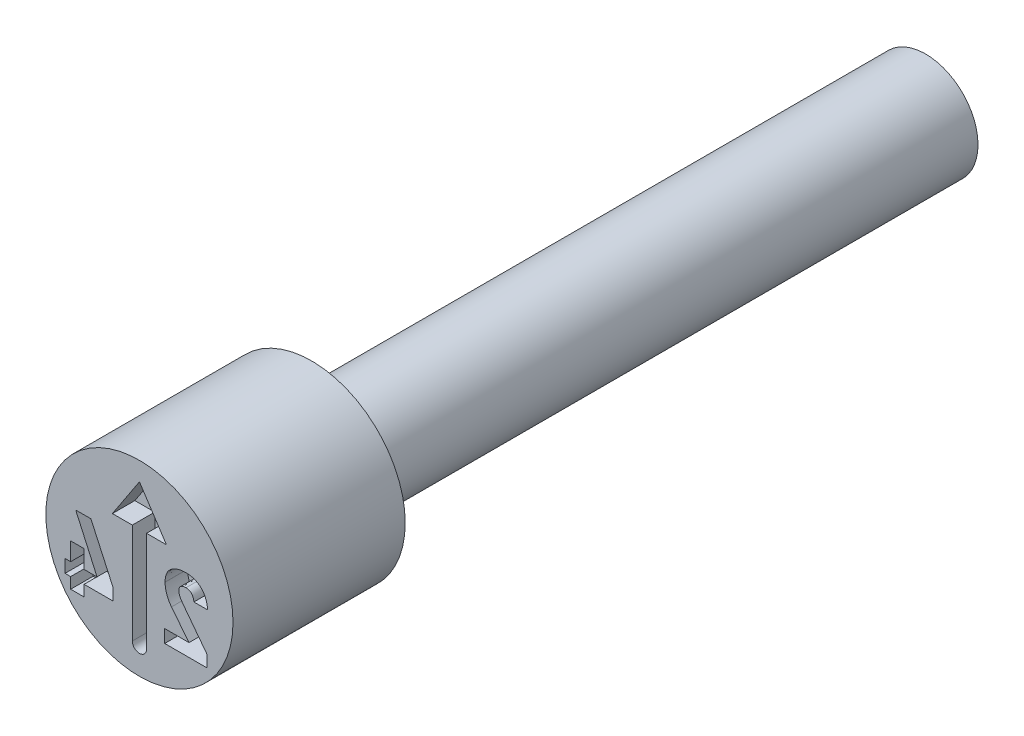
from build123d import *

# Parameters (mm, degrees)
CUT_EXTRUDE4_DEPTH = 0.3
SKETCH4_W          = 0.179080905
SKETCH4_H          = 0.559313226
CUT_EXTRUDE5_DEPTH = 0.3


with BuildPart() as part:
    # Sketch2 → Revolve1 (revolve)
    with BuildSketch(Plane(origin=(0, 0, 0), x_dir=(0, 0, -1), z_dir=(1, 0, 0)), mode=Mode.PRIVATE) as revolve1_sk:
        Polygon((0, 1.25), (0, 0), (10.5, 0), (10.5, 0.7), (2.3, 0.7), (2.3, 1.25), align=None)
    revolve(revolve1_sk.sketch.rotate(Axis((0, 0, -0.403888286), (0, 0, -1)), 90), axis=Axis((0, 0, -0.403888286), (0, 0, -1)))

    # Sketch3 → Cut-Extrude4 (cut)
    with BuildSketch(Plane.XY):
        with BuildLine():
            Line((0.095236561, 0.453175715), (0.095236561, -0.888080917))
            ThreePointArc((0.095236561, -0.888080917), (0, -0.983317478), (-0.095236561, -0.888080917))
            Line((-0.095236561, -0.888080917), (-0.095236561, 0.453175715))
            Line((-0.095236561, 0.453175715), (-0.360958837, 0.453175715))
            Line((-0.360958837, 0.453175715), (0, 1.001057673))
            Line((0, 1.001057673), (0.360958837, 0.453175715))
            Line((0.360958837, 0.453175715), (0.095236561, 0.453175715))
        make_face()
    extrude(amount=-CUT_EXTRUDE4_DEPTH, mode=Mode.SUBTRACT)

    # Sketch4 → Cut-Extrude5 (cut)
    with BuildSketch(Plane.XY):
        with BuildLine():
            Line((0.899358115, -0.538536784), (0.573334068, -0.109904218))
            add(Edge.make_bspline(
                [(0.573334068, -0.109904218), (0.566496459, -0.10041768), (0.553148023, -0.081897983), (0.541205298, -0.05635414), (0.533618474, -0.036325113), (0.530110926, -0.02179639), (0.527514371, -0.007903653), (0.527211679, 0.001211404), (0.527063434, 0.005675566)],
                knots=[0, 0, 0, 0, 1.660423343, 3.241491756, 3.993801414, 4.704207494, 5.365376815, 6, 6, 6, 6], degree=3))
            Line((0.527063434, 0.005675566), (0.527063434, 0.007030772))
            add(Edge.make_bspline(
                [(0.527063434, 0.007030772), (0.527323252, 0.013130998), (0.527818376, 0.024755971), (0.532598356, 0.041111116), (0.540502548, 0.055253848), (0.551574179, 0.067109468), (0.565657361, 0.07622106), (0.582269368, 0.082877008), (0.601498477, 0.086643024), (0.615135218, 0.08712265), (0.622315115, 0.087375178)],
                knots=[0, 0, 0, 0, 1.033361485, 1.969238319, 2.861873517, 3.760870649, 4.693536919, 5.686153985, 6.781734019, 8, 8, 8, 8], degree=3))
            add(Edge.make_bspline(
                [(0.622315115, 0.087375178), (0.62938521, 0.087076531), (0.643106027, 0.086496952), (0.662623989, 0.08097414), (0.679962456, 0.07159799), (0.694971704, 0.058639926), (0.707565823, 0.042338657), (0.716848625, 0.022700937), (0.724324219, 0.000381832), (0.726493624, -0.015817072), (0.727634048, -0.024332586)],
                knots=[0, 0, 0, 0, 0.993701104, 1.928459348, 2.826878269, 3.748294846, 4.700551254, 5.70417143, 6.793118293, 8, 8, 8, 8], degree=3))
            Line((0.727634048, -0.024332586), (0.911167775, -0.02510699))
            add(Edge.make_bspline(
                [(0.911167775, -0.02510699), (0.909852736, -0.010030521), (0.90729096, 0.017830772), (0.898580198, 0.057897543), (0.885711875, 0.094764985), (0.869270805, 0.128534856), (0.849111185, 0.158780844), (0.825720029, 0.185494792), (0.798838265, 0.208157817), (0.76893152, 0.226989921), (0.736130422, 0.24172795), (0.700836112, 0.252466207), (0.662995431, 0.258656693), (0.636986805, 0.259461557), (0.623670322, 0.25987365)],
                knots=[0, 0, 0, 0, 1.143950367, 2.228484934, 3.258162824, 4.249580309, 5.213917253, 6.146796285, 7.070112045, 8.006232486, 8.954636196, 9.927630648, 10.9389416, 12, 12, 12, 12], degree=3))
            add(Edge.make_bspline(
                [(0.623670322, 0.25987365), (0.609390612, 0.259575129), (0.581753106, 0.25899736), (0.541956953, 0.253558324), (0.505363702, 0.244507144), (0.472065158, 0.231790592), (0.442279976, 0.215443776), (0.415870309, 0.196040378), (0.393581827, 0.172827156), (0.375042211, 0.14645659), (0.36042731, 0.117030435), (0.350192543, 0.084574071), (0.343924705, 0.049348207), (0.343152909, 0.024868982), (0.342755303, 0.012257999)],
                knots=[0, 0, 0, 0, 1.208591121, 2.339154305, 3.392741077, 4.394302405, 5.348037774, 6.261656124, 7.158186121, 8.060194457, 8.981460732, 9.928425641, 10.932785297, 12, 12, 12, 12], degree=3))
            add(Edge.make_bspline(
                [(0.342755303, 0.012257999), (0.343003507, 0.000692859), (0.343500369, -0.020908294), (0.34793173, -0.053179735), (0.355177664, -0.085264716), (0.36500942, -0.117050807), (0.377286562, -0.148007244), (0.391938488, -0.177640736), (0.408666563, -0.205875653), (0.421774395, -0.223337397), (0.428326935, -0.232066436)],
                knots=[0, 0, 0, 0, 0.985191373, 1.972179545, 2.968870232, 3.986806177, 5.007996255, 6.007036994, 7.003727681, 8, 8, 8, 8], degree=3))
            Line((0.428326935, -0.232066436), (0.662196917, -0.527501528))
            Line((0.662196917, -0.527501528), (0.337528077, -0.527501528))
            Line((0.337528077, -0.527501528), (0.337528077, -0.7))
            Line((0.337528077, -0.7), (0.899358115, -0.7))
            Line((0.899358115, -0.7), (0.899358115, -0.538536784))
        make_face()
        Polygon((-0.355594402, -0.389657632), (-0.648319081, 0.249419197), (-0.851019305, 0.249419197), (-0.566038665, -0.381719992), (-0.992735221, -0.381719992), (-0.992735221, -0.554218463), (-0.355594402, -0.554218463), align=None)
        with Locations((-0.828658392, -0.42092419)):
            Rectangle(SKETCH4_W, SKETCH4_H)
    extrude(amount=-CUT_EXTRUDE5_DEPTH, mode=Mode.SUBTRACT)


solid = part.part
